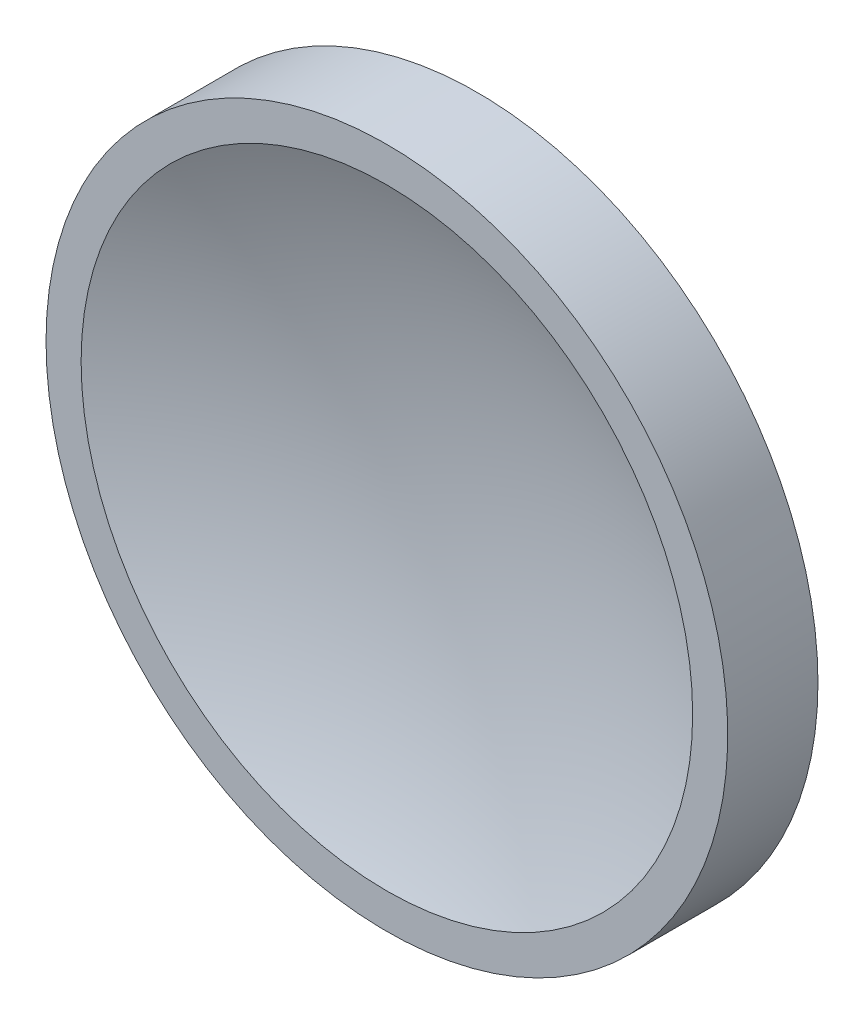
from build123d import *

# Parameters (mm, degrees)
SKETCH1_R           = 17
BOSS_EXTRUDE1_DEPTH = 5.288
SKETCH4_W           = 1.75
SKETCH4_H           = 0.788321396


with BuildPart() as part:
    # Sketch1 → Boss-Extrude1 (new body)
    with BuildSketch(Plane.XY):
        Circle(SKETCH1_R)
    extrude(amount=BOSS_EXTRUDE1_DEPTH)

    # Sketch2 → Revolve1 (revolve)
    with BuildSketch(Plane(origin=(0, 0, 0), x_dir=(1, 0, 0), z_dir=(0, 1, 0))):
        with BuildLine():
            Line((17, 0), (0, 0))
            Line((0, 0), (0, 2.660216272))
            ThreePointArc((0, 2.660216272), (8.603440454, 1.991140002), (17, 0))
        make_face()
    revolve(axis=Axis((0, 0, 0), (0, 0, -1)))

    # Sketch3 → Cut-Revolve3 (revolve, cut)
    with BuildSketch(Plane(origin=(0, 0, 0), x_dir=(1, 0, 0), z_dir=(0, 1, 0)), mode=Mode.PRIVATE) as cut_revolve3_sk:
        with BuildLine():
            Line((0, -1.417835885), (0, -5.288))
            Line((0, -5.288), (17, -5.288))
            ThreePointArc((17, -5.288), (8.717484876, -2.397598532), (0, -1.417835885))
        make_face()
    revolve(cut_revolve3_sk.sketch.rotate(Axis((0, 0, 1.417835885), (0, 0, 1)), 180), axis=Axis((0, 0, 1.417835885), (0, 0, 1)), mode=Mode.SUBTRACT)

    # Sketch4 → Cut-Revolve4 (revolve, cut)
    with BuildSketch(Plane(origin=(0, 0, 0), x_dir=(1, 0, 0), z_dir=(0, 1, 0))):
        with Locations((-16.125, -4.893839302)):
            Rectangle(SKETCH4_W, SKETCH4_H)
    revolve(axis=Axis((0, 0, 0), (0, 0, 1)), mode=Mode.SUBTRACT)


solid = part.part
